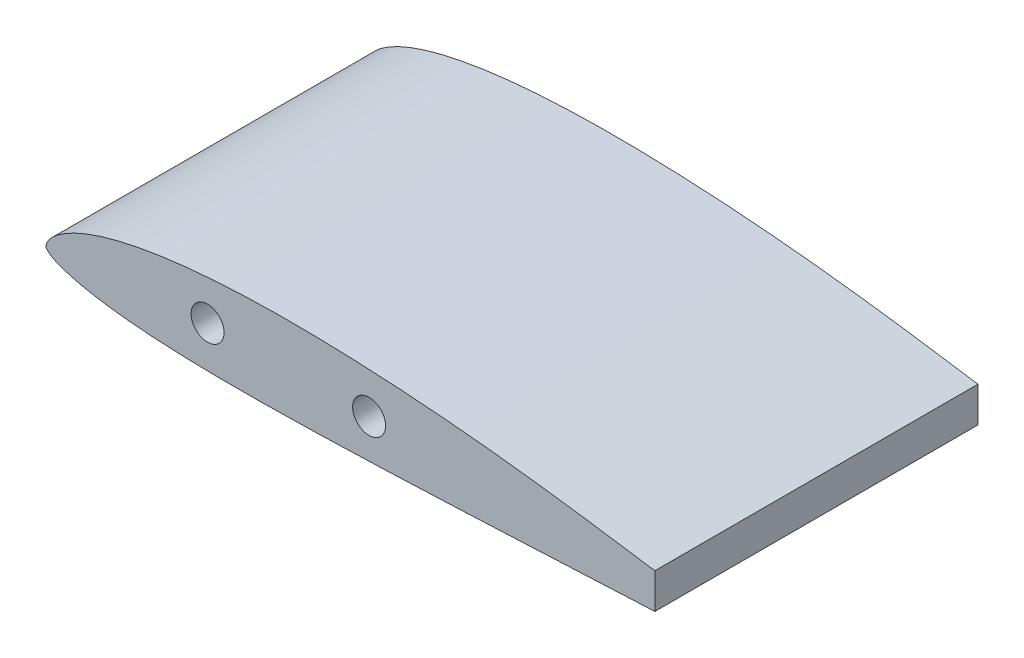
ISO-10303-21;
HEADER;
FILE_DESCRIPTION(('STEP AP214'),'2;1');
FILE_NAME('part.step','',(''),(''),'','','');
FILE_SCHEMA(('AUTOMOTIVE_DESIGN { 1 0 10303 214 1 1 1 1 }'));
ENDSEC;
DATA;
#1=APPLICATION_CONTEXT('core data for automotive mechanical design processes');
#2=APPLICATION_PROTOCOL_DEFINITION('international standard','automotive_design',2000,#1);
#3=PRODUCT_CONTEXT('',#1,'mechanical');
#4=PRODUCT('Part','Part','',(#3));
#5=PRODUCT_RELATED_PRODUCT_CATEGORY('part','',(#4));
#6=PRODUCT_DEFINITION_FORMATION('','',#4);
#7=PRODUCT_DEFINITION_CONTEXT('part definition',#1,'design');
#8=PRODUCT_DEFINITION('design','',#6,#7);
#9=PRODUCT_DEFINITION_SHAPE('','',#8);
#10=(LENGTH_UNIT() NAMED_UNIT(*) SI_UNIT(.MILLI.,.METRE.));
#11=(NAMED_UNIT(*) PLANE_ANGLE_UNIT() SI_UNIT($,.RADIAN.));
#12=(NAMED_UNIT(*) SI_UNIT($,.STERADIAN.) SOLID_ANGLE_UNIT());
#13=UNCERTAINTY_MEASURE_WITH_UNIT(LENGTH_MEASURE(1.E-05),#10,'distance_accuracy_value','');
#14=(GEOMETRIC_REPRESENTATION_CONTEXT(3) GLOBAL_UNCERTAINTY_ASSIGNED_CONTEXT((#13)) GLOBAL_UNIT_ASSIGNED_CONTEXT((#10,
#11,#12)) REPRESENTATION_CONTEXT('',''));
#15=CARTESIAN_POINT('',(0.,0.,0.));
#16=DIRECTION('',(0.,0.,1.));
#17=DIRECTION('',(1.,0.,0.));
#18=AXIS2_PLACEMENT_3D('',#15,#16,#17);
#19=CARTESIAN_POINT('',(188.450009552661,7.33921432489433,-50.));
#20=CARTESIAN_POINT('',(186.971120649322,7.56045867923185,-50.));
#21=CARTESIAN_POINT('',(181.340460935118,8.40384020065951,-50.));
#22=CARTESIAN_POINT('',(171.477012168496,9.87348202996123,-50.));
#23=CARTESIAN_POINT('',(158.801394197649,11.6487291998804,-50.));
#24=CARTESIAN_POINT('',(145.970739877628,13.2678550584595,-50.));
#25=CARTESIAN_POINT('',(133.084342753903,14.6710071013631,-50.));
#26=CARTESIAN_POINT('',(120.243383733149,15.821528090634,-50.));
#27=CARTESIAN_POINT('',(107.557769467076,16.7140018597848,-50.));
#28=CARTESIAN_POINT('',(95.144877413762,17.3385630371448,-50.));
#29=CARTESIAN_POINT('',(83.1254931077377,17.6806731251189,-50.));
#30=CARTESIAN_POINT('',(71.6144180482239,17.7308809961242,-50.));
#31=CARTESIAN_POINT('',(60.7151095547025,17.4651481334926,-50.));
#32=CARTESIAN_POINT('',(50.5186234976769,16.8816081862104,-50.));
#33=CARTESIAN_POINT('',(41.10453169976,15.986029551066,-50.));
#34=CARTESIAN_POINT('',(32.5447820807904,14.7966399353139,-50.));
#35=CARTESIAN_POINT('',(24.9029687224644,13.3392900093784,-50.));
#36=CARTESIAN_POINT('',(18.2308662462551,11.6478938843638,-50.));
#37=CARTESIAN_POINT('',(12.567751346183,9.74446836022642,-50.));
#38=CARTESIAN_POINT('',(7.93788056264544,7.6851976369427,-50.));
#39=CARTESIAN_POINT('',(4.34512866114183,5.54920971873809,-50.));
#40=CARTESIAN_POINT('',(1.8737427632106,3.502082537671,-50.));
#41=CARTESIAN_POINT('',(0.600881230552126,1.90576277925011,-50.));
#42=CARTESIAN_POINT('',(0.156814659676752,0.90504616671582,-50.));
#43=CARTESIAN_POINT('',(0.0277394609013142,0.443615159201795,-50.));
#44=CARTESIAN_POINT('',(-0.0126982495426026,0.0763974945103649,-50.));
#45=CARTESIAN_POINT('',(0.0187592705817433,-0.214234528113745,-50.));
#46=CARTESIAN_POINT('',(0.157842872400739,-0.479662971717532,-50.));
#47=CARTESIAN_POINT('',(0.41120960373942,-0.787972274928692,-50.));
#48=CARTESIAN_POINT('',(0.809035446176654,-1.14883379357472,-50.));
#49=CARTESIAN_POINT('',(1.24264773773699,-1.46107210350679,-50.));
#50=CARTESIAN_POINT('',(2.42793524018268,-2.22151934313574,-50.));
#51=CARTESIAN_POINT('',(4.87906409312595,-3.26332845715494,-50.));
#52=CARTESIAN_POINT('',(9.07858848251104,-4.51796108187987,-50.));
#53=CARTESIAN_POINT('',(14.5044801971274,-5.66289769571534,-50.));
#54=CARTESIAN_POINT('',(21.0901537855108,-6.657087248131,-50.));
#55=CARTESIAN_POINT('',(28.7948867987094,-7.4460538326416,-50.));
#56=CARTESIAN_POINT('',(37.5633136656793,-8.00800971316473,-50.));
#57=CARTESIAN_POINT('',(47.3355539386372,-8.34342767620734,-50.));
#58=CARTESIAN_POINT('',(58.0338665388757,-8.45940107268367,-50.));
#59=CARTESIAN_POINT('',(69.5623331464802,-8.38944631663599,-50.));
#60=CARTESIAN_POINT('',(86.2541277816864,-8.06688588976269,-50.));
#61=CARTESIAN_POINT('',(108.23107656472,-7.30664840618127,-50.));
#62=CARTESIAN_POINT('',(130.695416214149,-6.31538390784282,-50.));
#63=CARTESIAN_POINT('',(148.948878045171,-5.46584366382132,-50.));
#64=CARTESIAN_POINT('',(162.467008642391,-4.82221257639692,-50.));
#65=CARTESIAN_POINT('',(175.612989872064,-4.19480078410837,-50.));
#66=CARTESIAN_POINT('',(184.234269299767,-3.78129747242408,-50.));
#67=CARTESIAN_POINT('',(188.450009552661,-3.57970144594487,-50.));
#68=B_SPLINE_CURVE_WITH_KNOTS('',3,(#19,#20,#21,#22,#23,#24,#25,#26,#27,#28,#29,#30,#31,#32,#33,
#34,#35,#36,#37,#38,#39,#40,#41,#42,#43,#44,#45,#46,#47,#48,#49,#50,#51,#52,#53,#54,#55,#56,#57,
#58,#59,#60,#61,#62,#63,#64,#65,#66,#67),.UNSPECIFIED.,.F.,.F.,(4,1,1,1,1,1,1,1,1,1,1,1,1,1,1,1,
1,1,1,1,1,1,1,1,1,1,1,1,1,1,1,1,1,1,1,1,1,1,1,1,1,1,1,1,1,1,4),(0.133852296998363,
0.142437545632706,0.16654026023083,0.191106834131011,0.215921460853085,0.240786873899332,
0.265525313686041,0.289936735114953,0.313794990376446,0.336877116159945,0.358966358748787,
0.379877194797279,0.3994626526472,0.417591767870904,0.434156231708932,0.449061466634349,
0.462234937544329,0.47364581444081,0.483320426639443,0.491279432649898,0.497559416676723,
0.501679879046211,0.502824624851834,0.503826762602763,0.50441659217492,0.504939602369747,
0.50547665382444,0.50610854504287,0.507226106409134,0.508548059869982,0.50917295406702,
0.515309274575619,0.523717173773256,0.534339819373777,0.54710681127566,0.561945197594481,
0.578791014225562,0.597544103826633,0.618077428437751,0.64021344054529,0.663731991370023,
0.713926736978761,0.766462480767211,0.792832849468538,0.818839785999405,0.844162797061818,
0.868394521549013),.UNSPECIFIED.);
#69=DIRECTION('',(0.,0.,1.));
#70=VECTOR('',#69,1.);
#71=SURFACE_OF_LINEAR_EXTRUSION('',#68,#70);
#72=DIRECTION('',(0.,0.,1.));
#73=VECTOR('',#72,1.);
#74=CARTESIAN_POINT('',(188.450009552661,-3.57970144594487,-50.));
#75=LINE('',#74,#73);
#76=CARTESIAN_POINT('',(188.450009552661,-3.57970144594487,-50.));
#77=VERTEX_POINT('',#76);
#78=CARTESIAN_POINT('',(188.450009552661,-3.57970144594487,50.));
#79=VERTEX_POINT('',#78);
#80=EDGE_CURVE('E47',#77,#79,#75,.T.);
#81=ORIENTED_EDGE('',*,*,#80,.T.);
#82=CARTESIAN_POINT('',(188.450009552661,7.33921432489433,50.));
#83=CARTESIAN_POINT('',(186.971120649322,7.56045867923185,50.));
#84=CARTESIAN_POINT('',(181.340460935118,8.40384020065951,50.));
#85=CARTESIAN_POINT('',(171.477012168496,9.87348202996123,50.));
#86=CARTESIAN_POINT('',(158.801394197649,11.6487291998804,50.));
#87=CARTESIAN_POINT('',(145.970739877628,13.2678550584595,50.));
#88=CARTESIAN_POINT('',(133.084342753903,14.6710071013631,50.));
#89=CARTESIAN_POINT('',(120.243383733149,15.821528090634,50.));
#90=CARTESIAN_POINT('',(107.557769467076,16.7140018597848,50.));
#91=CARTESIAN_POINT('',(95.144877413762,17.3385630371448,50.));
#92=CARTESIAN_POINT('',(83.1254931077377,17.6806731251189,50.));
#93=CARTESIAN_POINT('',(71.6144180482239,17.7308809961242,50.));
#94=CARTESIAN_POINT('',(60.7151095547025,17.4651481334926,50.));
#95=CARTESIAN_POINT('',(50.5186234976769,16.8816081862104,50.));
#96=CARTESIAN_POINT('',(41.10453169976,15.986029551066,50.));
#97=CARTESIAN_POINT('',(32.5447820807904,14.7966399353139,50.));
#98=CARTESIAN_POINT('',(24.9029687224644,13.3392900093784,50.));
#99=CARTESIAN_POINT('',(18.2308662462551,11.6478938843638,50.));
#100=CARTESIAN_POINT('',(12.567751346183,9.74446836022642,50.));
#101=CARTESIAN_POINT('',(7.93788056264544,7.6851976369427,50.));
#102=CARTESIAN_POINT('',(4.34512866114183,5.54920971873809,50.));
#103=CARTESIAN_POINT('',(1.8737427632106,3.502082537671,50.));
#104=CARTESIAN_POINT('',(0.600881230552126,1.90576277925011,50.));
#105=CARTESIAN_POINT('',(0.156814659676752,0.90504616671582,50.));
#106=CARTESIAN_POINT('',(0.0277394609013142,0.443615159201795,50.));
#107=CARTESIAN_POINT('',(-0.0126982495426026,0.0763974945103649,50.));
#108=CARTESIAN_POINT('',(0.0187592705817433,-0.214234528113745,50.));
#109=CARTESIAN_POINT('',(0.157842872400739,-0.479662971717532,50.));
#110=CARTESIAN_POINT('',(0.41120960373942,-0.787972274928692,50.));
#111=CARTESIAN_POINT('',(0.809035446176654,-1.14883379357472,50.));
#112=CARTESIAN_POINT('',(1.24264773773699,-1.46107210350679,50.));
#113=CARTESIAN_POINT('',(2.42793524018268,-2.22151934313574,50.));
#114=CARTESIAN_POINT('',(4.87906409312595,-3.26332845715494,50.));
#115=CARTESIAN_POINT('',(9.07858848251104,-4.51796108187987,50.));
#116=CARTESIAN_POINT('',(14.5044801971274,-5.66289769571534,50.));
#117=CARTESIAN_POINT('',(21.0901537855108,-6.657087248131,50.));
#118=CARTESIAN_POINT('',(28.7948867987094,-7.4460538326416,50.));
#119=CARTESIAN_POINT('',(37.5633136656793,-8.00800971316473,50.));
#120=CARTESIAN_POINT('',(47.3355539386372,-8.34342767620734,50.));
#121=CARTESIAN_POINT('',(58.0338665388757,-8.45940107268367,50.));
#122=CARTESIAN_POINT('',(69.5623331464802,-8.38944631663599,50.));
#123=CARTESIAN_POINT('',(86.2541277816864,-8.06688588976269,50.));
#124=CARTESIAN_POINT('',(108.23107656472,-7.30664840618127,50.));
#125=CARTESIAN_POINT('',(130.695416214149,-6.31538390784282,50.));
#126=CARTESIAN_POINT('',(148.948878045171,-5.46584366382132,50.));
#127=CARTESIAN_POINT('',(162.467008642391,-4.82221257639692,50.));
#128=CARTESIAN_POINT('',(175.612989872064,-4.19480078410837,50.));
#129=CARTESIAN_POINT('',(184.234269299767,-3.78129747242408,50.));
#130=CARTESIAN_POINT('',(188.450009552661,-3.57970144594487,50.));
#131=B_SPLINE_CURVE_WITH_KNOTS('',3,(#82,#83,#84,#85,#86,#87,#88,#89,#90,#91,#92,#93,#94,#95,
#96,#97,#98,#99,#100,#101,#102,#103,#104,#105,#106,#107,#108,#109,#110,#111,#112,#113,#114,#115,
#116,#117,#118,#119,#120,#121,#122,#123,#124,#125,#126,#127,#128,#129,#130),.UNSPECIFIED.,.F.,
.F.,(4,1,1,1,1,1,1,1,1,1,1,1,1,1,1,1,1,1,1,1,1,1,1,1,1,1,1,1,1,1,1,1,1,1,1,1,1,1,1,1,1,1,1,1,1,
1,4),(0.133852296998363,0.142437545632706,0.16654026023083,0.191106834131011,0.215921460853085,
0.240786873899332,0.265525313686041,0.289936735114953,0.313794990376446,0.336877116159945,
0.358966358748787,0.379877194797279,0.3994626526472,0.417591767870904,0.434156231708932,
0.449061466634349,0.462234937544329,0.47364581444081,0.483320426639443,0.491279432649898,
0.497559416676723,0.501679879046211,0.502824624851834,0.503826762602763,0.50441659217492,
0.504939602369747,0.50547665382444,0.50610854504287,0.507226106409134,0.508548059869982,
0.50917295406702,0.515309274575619,0.523717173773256,0.534339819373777,0.54710681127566,
0.561945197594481,0.578791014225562,0.597544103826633,0.618077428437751,0.64021344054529,
0.663731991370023,0.713926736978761,0.766462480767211,0.792832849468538,0.818839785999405,
0.844162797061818,0.868394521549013),.UNSPECIFIED.);
#132=CARTESIAN_POINT('',(188.450009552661,7.33921432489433,50.));
#133=VERTEX_POINT('',#132);
#134=EDGE_CURVE('E69',#133,#79,#131,.T.);
#135=ORIENTED_EDGE('',*,*,#134,.F.);
#136=DIRECTION('',(0.,0.,1.));
#137=VECTOR('',#136,1.);
#138=CARTESIAN_POINT('',(188.450009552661,7.33921432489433,-50.));
#139=LINE('',#138,#137);
#140=CARTESIAN_POINT('',(188.450009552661,7.33921432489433,-50.));
#141=VERTEX_POINT('',#140);
#142=EDGE_CURVE('E11',#141,#133,#139,.T.);
#143=ORIENTED_EDGE('',*,*,#142,.F.);
#144=EDGE_CURVE('E70',#141,#77,#68,.T.);
#145=ORIENTED_EDGE('',*,*,#144,.T.);
#146=EDGE_LOOP('',(#81,#135,#143,#145));
#147=FACE_BOUND('',#146,.T.);
#148=ADVANCED_FACE('F43',(#147),#71,.T.);
#149=CARTESIAN_POINT('',(188.450009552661,7.33921432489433,-50.));
#150=DIRECTION('',(1.,0.,0.));
#151=DIRECTION('',(0.,1.,0.));
#152=AXIS2_PLACEMENT_3D('',#149,#150,#151);
#153=PLANE('',#152);
#154=ORIENTED_EDGE('',*,*,#142,.T.);
#155=DIRECTION('',(0.,1.,0.));
#156=VECTOR('',#155,1.);
#157=CARTESIAN_POINT('',(188.450009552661,7.33921432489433,50.));
#158=LINE('',#157,#156);
#159=EDGE_CURVE('E75',#79,#133,#158,.T.);
#160=ORIENTED_EDGE('',*,*,#159,.F.);
#161=ORIENTED_EDGE('',*,*,#80,.F.);
#162=DIRECTION('',(0.,1.,0.));
#163=VECTOR('',#162,1.);
#164=CARTESIAN_POINT('',(188.450009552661,7.33921432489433,-50.));
#165=LINE('',#164,#163);
#166=EDGE_CURVE('E73',#77,#141,#165,.T.);
#167=ORIENTED_EDGE('',*,*,#166,.T.);
#168=EDGE_LOOP('',(#154,#160,#161,#167));
#169=FACE_BOUND('',#168,.T.);
#170=ADVANCED_FACE('F76',(#169),#153,.T.);
#171=CARTESIAN_POINT('',(0.539164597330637,1.68037236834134,-50.));
#172=DIRECTION('',(0.,0.,1.));
#173=DIRECTION('',(1.,0.,0.));
#174=AXIS2_PLACEMENT_3D('',#171,#172,#173);
#175=PLANE('',#174);
#176=CARTESIAN_POINT('',(100.,4.47,-50.));
#177=DIRECTION('',(0.,0.,1.));
#178=DIRECTION('',(1.,0.,0.));
#179=AXIS2_PLACEMENT_3D('',#176,#177,#178);
#180=CIRCLE('',#179,5.1);
#181=CARTESIAN_POINT('',(105.1,4.47,-50.));
#182=VERTEX_POINT('',#181);
#183=EDGE_CURVE('E249',#182,#182,#180,.T.);
#184=ORIENTED_EDGE('',*,*,#183,.T.);
#185=EDGE_LOOP('',(#184));
#186=FACE_BOUND('',#185,.T.);
#187=CARTESIAN_POINT('',(50.,4.47,-50.));
#188=DIRECTION('',(0.,0.,1.));
#189=DIRECTION('',(1.,0.,0.));
#190=AXIS2_PLACEMENT_3D('',#187,#188,#189);
#191=CIRCLE('',#190,5.1);
#192=CARTESIAN_POINT('',(55.1,4.47,-50.));
#193=VERTEX_POINT('',#192);
#194=EDGE_CURVE('E261',#193,#193,#191,.T.);
#195=ORIENTED_EDGE('',*,*,#194,.T.);
#196=EDGE_LOOP('',(#195));
#197=FACE_BOUND('',#196,.T.);
#198=ORIENTED_EDGE('',*,*,#144,.F.);
#199=ORIENTED_EDGE('',*,*,#166,.F.);
#200=EDGE_LOOP('',(#198,#199));
#201=FACE_BOUND('',#200,.T.);
#202=ADVANCED_FACE('F106',(#186,#197,#201),#175,.F.);
#203=CARTESIAN_POINT('',(0.539164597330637,1.68037236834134,50.));
#204=DIRECTION('',(0.,0.,1.));
#205=DIRECTION('',(1.,0.,0.));
#206=AXIS2_PLACEMENT_3D('',#203,#204,#205);
#207=PLANE('',#206);
#208=CARTESIAN_POINT('',(100.,4.47,50.));
#209=DIRECTION('',(0.,0.,1.));
#210=DIRECTION('',(1.,0.,0.));
#211=AXIS2_PLACEMENT_3D('',#208,#209,#210);
#212=CIRCLE('',#211,5.1);
#213=CARTESIAN_POINT('',(105.1,4.47,50.));
#214=VERTEX_POINT('',#213);
#215=EDGE_CURVE('E86',#214,#214,#212,.T.);
#216=ORIENTED_EDGE('',*,*,#215,.F.);
#217=EDGE_LOOP('',(#216));
#218=FACE_BOUND('',#217,.T.);
#219=CARTESIAN_POINT('',(50.,4.47,50.));
#220=DIRECTION('',(0.,0.,1.));
#221=DIRECTION('',(1.,0.,0.));
#222=AXIS2_PLACEMENT_3D('',#219,#220,#221);
#223=CIRCLE('',#222,5.1);
#224=CARTESIAN_POINT('',(55.1,4.47,50.));
#225=VERTEX_POINT('',#224);
#226=EDGE_CURVE('E254',#225,#225,#223,.T.);
#227=ORIENTED_EDGE('',*,*,#226,.F.);
#228=EDGE_LOOP('',(#227));
#229=FACE_BOUND('',#228,.T.);
#230=ORIENTED_EDGE('',*,*,#134,.T.);
#231=ORIENTED_EDGE('',*,*,#159,.T.);
#232=EDGE_LOOP('',(#230,#231));
#233=FACE_BOUND('',#232,.T.);
#234=ADVANCED_FACE('F80',(#218,#229,#233),#207,.T.);
#235=CARTESIAN_POINT('',(50.,4.47,20.));
#236=DIRECTION('',(0.,0.,1.));
#237=DIRECTION('',(1.,0.,0.));
#238=AXIS2_PLACEMENT_3D('',#235,#236,#237);
#239=CYLINDRICAL_SURFACE('',#238,5.1);
#240=CARTESIAN_POINT('',(50.,4.47,20.));
#241=DIRECTION('',(0.,0.,1.));
#242=DIRECTION('',(1.,0.,0.));
#243=AXIS2_PLACEMENT_3D('',#240,#241,#242);
#244=CIRCLE('',#243,5.1);
#245=CARTESIAN_POINT('',(55.1,4.47,20.));
#246=VERTEX_POINT('',#245);
#247=EDGE_CURVE('E91',#246,#246,#244,.T.);
#248=ORIENTED_EDGE('',*,*,#247,.F.);
#249=EDGE_LOOP('',(#248));
#250=FACE_BOUND('',#249,.T.);
#251=ORIENTED_EDGE('',*,*,#226,.T.);
#252=EDGE_LOOP('',(#251));
#253=FACE_BOUND('',#252,.T.);
#254=ADVANCED_FACE('F114',(#250,#253),#239,.F.);
#255=CARTESIAN_POINT('',(50.,4.47,20.));
#256=DIRECTION('',(0.,0.,1.));
#257=DIRECTION('',(1.,0.,0.));
#258=AXIS2_PLACEMENT_3D('',#255,#256,#257);
#259=PLANE('',#258);
#260=ORIENTED_EDGE('',*,*,#247,.T.);
#261=EDGE_LOOP('',(#260));
#262=FACE_BOUND('',#261,.T.);
#263=ADVANCED_FACE('F144',(#262),#259,.T.);
#264=CARTESIAN_POINT('',(100.,4.47,20.));
#265=DIRECTION('',(0.,0.,1.));
#266=DIRECTION('',(1.,0.,0.));
#267=AXIS2_PLACEMENT_3D('',#264,#265,#266);
#268=CYLINDRICAL_SURFACE('',#267,5.1);
#269=CARTESIAN_POINT('',(100.,4.47,20.));
#270=DIRECTION('',(0.,0.,1.));
#271=DIRECTION('',(1.,0.,0.));
#272=AXIS2_PLACEMENT_3D('',#269,#270,#271);
#273=CIRCLE('',#272,5.1);
#274=CARTESIAN_POINT('',(105.1,4.47,20.));
#275=VERTEX_POINT('',#274);
#276=EDGE_CURVE('E82',#275,#275,#273,.T.);
#277=ORIENTED_EDGE('',*,*,#276,.F.);
#278=EDGE_LOOP('',(#277));
#279=FACE_BOUND('',#278,.T.);
#280=ORIENTED_EDGE('',*,*,#215,.T.);
#281=EDGE_LOOP('',(#280));
#282=FACE_BOUND('',#281,.T.);
#283=ADVANCED_FACE('F155',(#279,#282),#268,.F.);
#284=CARTESIAN_POINT('',(100.,4.47,20.));
#285=DIRECTION('',(0.,0.,1.));
#286=DIRECTION('',(1.,0.,0.));
#287=AXIS2_PLACEMENT_3D('',#284,#285,#286);
#288=PLANE('',#287);
#289=ORIENTED_EDGE('',*,*,#276,.T.);
#290=EDGE_LOOP('',(#289));
#291=FACE_BOUND('',#290,.T.);
#292=ADVANCED_FACE('F166',(#291),#288,.T.);
#293=CARTESIAN_POINT('',(50.,4.47,-20.));
#294=DIRECTION('',(0.,0.,-1.));
#295=DIRECTION('',(-1.,0.,0.));
#296=AXIS2_PLACEMENT_3D('',#293,#294,#295);
#297=CYLINDRICAL_SURFACE('',#296,5.1);
#298=CARTESIAN_POINT('',(50.,4.47,-20.));
#299=DIRECTION('',(0.,0.,1.));
#300=DIRECTION('',(1.,0.,0.));
#301=AXIS2_PLACEMENT_3D('',#298,#299,#300);
#302=CIRCLE('',#301,5.1);
#303=CARTESIAN_POINT('',(55.1,4.47,-20.));
#304=VERTEX_POINT('',#303);
#305=EDGE_CURVE('E255',#304,#304,#302,.T.);
#306=ORIENTED_EDGE('',*,*,#305,.T.);
#307=EDGE_LOOP('',(#306));
#308=FACE_BOUND('',#307,.T.);
#309=ORIENTED_EDGE('',*,*,#194,.F.);
#310=EDGE_LOOP('',(#309));
#311=FACE_BOUND('',#310,.T.);
#312=ADVANCED_FACE('F176',(#308,#311),#297,.F.);
#313=CARTESIAN_POINT('',(50.,4.47,-20.));
#314=DIRECTION('',(0.,0.,-1.));
#315=DIRECTION('',(1.,0.,0.));
#316=AXIS2_PLACEMENT_3D('',#313,#314,#315);
#317=PLANE('',#316);
#318=ORIENTED_EDGE('',*,*,#305,.F.);
#319=EDGE_LOOP('',(#318));
#320=FACE_BOUND('',#319,.T.);
#321=ADVANCED_FACE('F192',(#320),#317,.T.);
#322=CARTESIAN_POINT('',(100.,4.47,-20.));
#323=DIRECTION('',(0.,0.,-1.));
#324=DIRECTION('',(-1.,0.,0.));
#325=AXIS2_PLACEMENT_3D('',#322,#323,#324);
#326=CYLINDRICAL_SURFACE('',#325,5.1);
#327=CARTESIAN_POINT('',(100.,4.47,-20.));
#328=DIRECTION('',(0.,0.,1.));
#329=DIRECTION('',(1.,0.,0.));
#330=AXIS2_PLACEMENT_3D('',#327,#328,#329);
#331=CIRCLE('',#330,5.1);
#332=CARTESIAN_POINT('',(105.1,4.47,-20.));
#333=VERTEX_POINT('',#332);
#334=EDGE_CURVE('E247',#333,#333,#331,.T.);
#335=ORIENTED_EDGE('',*,*,#334,.T.);
#336=EDGE_LOOP('',(#335));
#337=FACE_BOUND('',#336,.T.);
#338=ORIENTED_EDGE('',*,*,#183,.F.);
#339=EDGE_LOOP('',(#338));
#340=FACE_BOUND('',#339,.T.);
#341=ADVANCED_FACE('F203',(#337,#340),#326,.F.);
#342=CARTESIAN_POINT('',(100.,4.47,-20.));
#343=DIRECTION('',(0.,0.,-1.));
#344=DIRECTION('',(1.,0.,0.));
#345=AXIS2_PLACEMENT_3D('',#342,#343,#344);
#346=PLANE('',#345);
#347=ORIENTED_EDGE('',*,*,#334,.F.);
#348=EDGE_LOOP('',(#347));
#349=FACE_BOUND('',#348,.T.);
#350=ADVANCED_FACE('F214',(#349),#346,.T.);
#351=CLOSED_SHELL('',(#148,#170,#202,#234,#254,#263,#283,#292,#312,#321,#341,#350));
#352=MANIFOLD_SOLID_BREP('B2',#351);
#353=ADVANCED_BREP_SHAPE_REPRESENTATION('',(#18,#352),#14);
#354=SHAPE_DEFINITION_REPRESENTATION(#9,#353);
ENDSEC;
END-ISO-10303-21;
